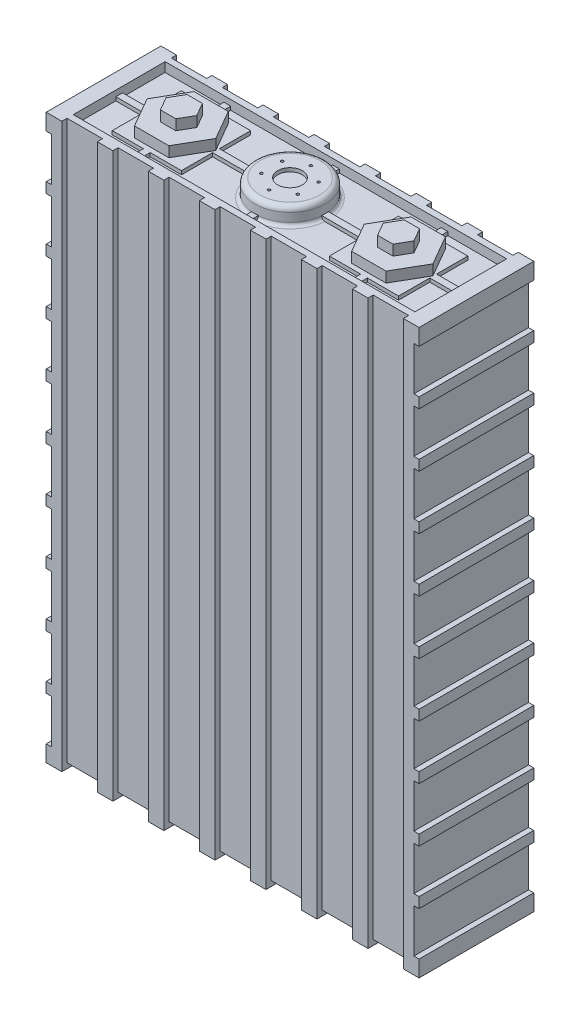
from build123d import *

# Parameters (mm, degrees)
SKETCH1_W           = 182
SKETCH1_H           = 275
BOSS_EXTRUDE1_DEPTH = 56
SKETCH2_W           = 56
SKETCH2_H           = 21.328
CUT_EXTRUDE1_DEPTH  = 2.54
SKETCH3_W           = 17.291428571
SKETCH3_H           = 275
SKETCH3_W_2         = 17.291428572
CUT_EXTRUDE2_DEPTH  = 2.54
SKETCH5_W           = 17.291428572
SKETCH5_H           = 50.92
SKETCH5_W_2         = 17.291428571
CUT_EXTRUDE3_DEPTH  = 2.54
SKETCH7_W           = 166.76
SKETCH7_H           = 44.824
CUT_EXTRUDE4_DEPTH  = 4.572
BOSS_EXTRUDE5_DEPTH = 1.778
SKETCH10_R          = 17.145
BOSS_EXTRUDE6_DEPTH = 8.382
FILLET2_R           = 2.54
FILLET4_R           = 1.6256
SKETCH11_R          = 6.023369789
CUT_EXTRUDE5_DEPTH  = 1.778
SKETCH12_R          = 0.648251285
CUT_EXTRUDE6_DEPTH  = 1.27
BOSS_EXTRUDE7_DEPTH = 5.08
BOSS_EXTRUDE8_DEPTH = 5.08


with BuildPart() as part:
    # Sketch1 → Boss-Extrude1 (new body)
    with BuildSketch(Plane.XY):
        with Locations((-91, 137.5)):
            Rectangle(SKETCH1_W, SKETCH1_H)
    extrude(amount=BOSS_EXTRUDE1_DEPTH)

    # Sketch2 → Cut-Extrude1 (cut)
    with BuildSketch(Plane.ZY.offset(182)):
        with Locations((28, 256.336)):
            Rectangle(SKETCH2_W, SKETCH2_H)
        with Locations((28, 229.928)):
            Rectangle(SKETCH2_W, SKETCH2_H)
        with Locations((28, 203.52)):
            Rectangle(SKETCH2_W, SKETCH2_H)
        with Locations((28, 177.112)):
            Rectangle(SKETCH2_W, SKETCH2_H)
        with Locations((28, 150.704)):
            Rectangle(SKETCH2_W, SKETCH2_H)
        with Locations((28, 124.296)):
            Rectangle(SKETCH2_W, SKETCH2_H)
        with Locations((28, 97.888)):
            Rectangle(SKETCH2_W, SKETCH2_H)
        with Locations((28, 71.48)):
            Rectangle(SKETCH2_W, SKETCH2_H)
        with Locations((28, 45.072)):
            Rectangle(SKETCH2_W, SKETCH2_H)
        with Locations((28, 18.664)):
            Rectangle(SKETCH2_W, SKETCH2_H)
    cut_extrude1 = extrude(amount=-CUT_EXTRUDE1_DEPTH, mode=Mode.SUBTRACT)

    # Mirror1: Cut-Extrude1 across plane
    add(cut_extrude1.mirror(Plane(origin=(-91, 0, 0), x_dir=(0, 0, 1), z_dir=(1, 0, 0))), mode=Mode.SUBTRACT)

    # Sketch3 → Cut-Extrude2 (cut)
    with BuildSketch(Plane.XY.offset(56)):
        with Locations((-165.734285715, 137.5)):
            Rectangle(SKETCH3_W, SKETCH3_H)
        with Locations((-140.822857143, 137.5)):
            Rectangle(SKETCH3_W_2, SKETCH3_H)
        with Locations((-115.911428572, 137.5)):
            Rectangle(SKETCH3_W, SKETCH3_H)
        with Locations((-91, 137.5)):
            Rectangle(SKETCH3_W_2, SKETCH3_H)
        with Locations((-66.088571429, 137.5)):
            Rectangle(SKETCH3_W, SKETCH3_H)
        with Locations((-41.177142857, 137.5)):
            Rectangle(SKETCH3_W_2, SKETCH3_H)
        with Locations((-16.265714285, 137.5)):
            Rectangle(SKETCH3_W, SKETCH3_H)
    cut_extrude2 = extrude(amount=-CUT_EXTRUDE2_DEPTH, mode=Mode.SUBTRACT)

    # Mirror2: Cut-Extrude2 across plane
    add(cut_extrude2.mirror(Plane.XY.offset(28)), mode=Mode.SUBTRACT)

    # Sketch5 → Cut-Extrude3 (cut)
    with BuildSketch(Plane.XZ):
        with Locations((-140.822857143, 28)):
            Rectangle(SKETCH5_W, SKETCH5_H)
        with Locations((-165.734285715, 28)):
            Rectangle(SKETCH5_W_2, SKETCH5_H)
        with Locations((-115.911428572, 28)):
            Rectangle(SKETCH5_W_2, SKETCH5_H)
        with Locations((-91, 28)):
            Rectangle(SKETCH5_W, SKETCH5_H)
        with Locations((-66.088571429, 28)):
            Rectangle(SKETCH5_W_2, SKETCH5_H)
        with Locations((-41.177142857, 28)):
            Rectangle(SKETCH5_W, SKETCH5_H)
        with Locations((-16.265714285, 28)):
            Rectangle(SKETCH5_W_2, SKETCH5_H)
    extrude(amount=-CUT_EXTRUDE3_DEPTH, mode=Mode.SUBTRACT)

    # Sketch7 → Cut-Extrude4 (cut)
    with BuildSketch(Plane(origin=(0, 275, 0), x_dir=(1, 0, 0), z_dir=(0, 1, 0))):
        with Locations((-91, -28)):
            Rectangle(SKETCH7_W, SKETCH7_H)
    extrude(amount=-CUT_EXTRUDE4_DEPTH, mode=Mode.SUBTRACT)

    # Sketch8 → Boss-Extrude5 (add)
    with BuildSketch(Plane(origin=(0, 270.428, 0), x_dir=(1, 0, 0), z_dir=(0, 1, 0))):
        Polygon((-142.349, -11.109), (-127.109, -11.109), (-127.109, -26.349), (-92.651, -26.349), (-92.651, -5.588), (-89.349, -5.588), (-89.349, -26.349), (-54.891, -26.349), (-54.891, -11.109), (-39.651, -11.109), (-39.651, -5.588), (-36.349, -5.588), (-36.349, -11.109), (-21.109, -11.109), (-21.109, -26.349), (-7.62, -26.349), (-7.62, -29.651), (-21.109, -29.651), (-21.109, -44.891), (-36.349, -44.891), (-36.349, -50.412), (-39.651, -50.412), (-39.651, -44.891), (-54.891, -44.891), (-54.891, -29.651), (-89.349, -29.651), (-89.349, -50.412), (-92.651, -50.412), (-92.651, -29.651), (-127.109, -29.651), (-127.109, -44.891), (-142.349, -44.891), (-142.349, -50.412), (-145.651, -50.412), (-145.651, -44.891), (-160.891, -44.891), (-160.891, -29.651), (-174.38, -29.651), (-174.38, -26.349), (-160.891, -26.349), (-160.891, -11.109), (-145.651, -11.109), (-145.651, -5.588), (-142.349, -5.588), align=None)
    extrude(amount=BOSS_EXTRUDE5_DEPTH)

    # Sketch10 → Boss-Extrude6 (add)
    with BuildSketch(Plane(origin=(0, 270.428, 0), x_dir=(-1, 0, 0), z_dir=(0, 1, 0))):
        with Locations(Location((91, 28, 0), (0, 0, 264.474065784))):
            Circle(SKETCH10_R)
    extrude(amount=BOSS_EXTRUDE6_DEPTH)

    # Fillet2
    fillet2_edges = [part.edges().sort_by_distance(p)[0] for p in [
        (-92.651, 278.81, 45.065322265),
    ]]
    fillet(fillet2_edges, radius=FILLET2_R)

    # Fillet4
    fillet4_edges = [part.edges().sort_by_distance(p)[0] for p in [
        (-103.123345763, 270.428, 40.123345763),
        (-78.876654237, 270.428, 40.123345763),
        (-78.876654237, 270.428, 15.876654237),
        (-103.123345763, 270.428, 15.876654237),
    ]]
    fillet(fillet4_edges, radius=FILLET4_R)

    # Sketch11 → Cut-Extrude5 (cut)
    with BuildSketch(Plane(origin=(0, 278.81, 0), x_dir=(1, 0, 0), z_dir=(0, 1, 0))):
        with Locations(Location((-91, -28, 0), (0, 0, 270))):
            Circle(SKETCH11_R)
    extrude(amount=-CUT_EXTRUDE5_DEPTH, mode=Mode.SUBTRACT)

    # Sketch12 → Cut-Extrude6 (cut)
    with BuildSketch(Plane(origin=(0, 278.81, 0), x_dir=(1, 0, 0), z_dir=(0, 1, 0))):
        with Locations(Location((-91, -38.230173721, 0), (0, 0, 270))):
            Circle(SKETCH12_R)
        with Locations(Location((-99.859590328, -33.115086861, 0), (0, 0, 270))):
            Circle(SKETCH12_R)
        with Locations(Location((-99.859590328, -22.884913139, 0), (0, 0, 270))):
            Circle(SKETCH12_R)
        with Locations(Location((-91, -17.769826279, 0), (0, 0, 270))):
            Circle(SKETCH12_R)
        with Locations(Location((-82.140409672, -22.884913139, 0), (0, 0, 270))):
            Circle(SKETCH12_R)
        with Locations(Location((-82.140409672, -33.115086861, 0), (0, 0, 270))):
            Circle(SKETCH12_R)
    extrude(amount=-CUT_EXTRUDE6_DEPTH, mode=Mode.SUBTRACT)

    # Sketch13 → Boss-Extrude7 (add)
    with BuildSketch(Plane(origin=(0, 272.206, 0), x_dir=(1, 0, 0), z_dir=(0, 1, 0))):
        Polygon((-127.236, -28), (-135.618, -13.481950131), (-152.382, -13.481950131), (-160.764, -28), (-152.382, -42.518049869), (-135.618, -42.518049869), align=None)
        Polygon((-21.236, -28), (-29.618, -13.481950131), (-46.382, -13.481950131), (-54.764, -28), (-46.382, -42.518049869), (-29.618, -42.518049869), align=None)
    extrude(amount=BOSS_EXTRUDE7_DEPTH)

    # Sketch14 → Boss-Extrude8 (add)
    with BuildSketch(Plane(origin=(0, 277.286, 0), x_dir=(1, 0, 0), z_dir=(0, 1, 0))):
        Polygon((-136.494446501, -28), (-140.24722325, -21.5), (-147.75277675, -21.5), (-151.505553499, -28), (-147.75277675, -34.5), (-140.24722325, -34.5), align=None)
        Polygon((-30.494446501, -28), (-34.24722325, -21.5), (-41.75277675, -21.5), (-45.505553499, -28), (-41.75277675, -34.5), (-34.24722325, -34.5), align=None)
    extrude(amount=BOSS_EXTRUDE8_DEPTH)


solid = part.part
